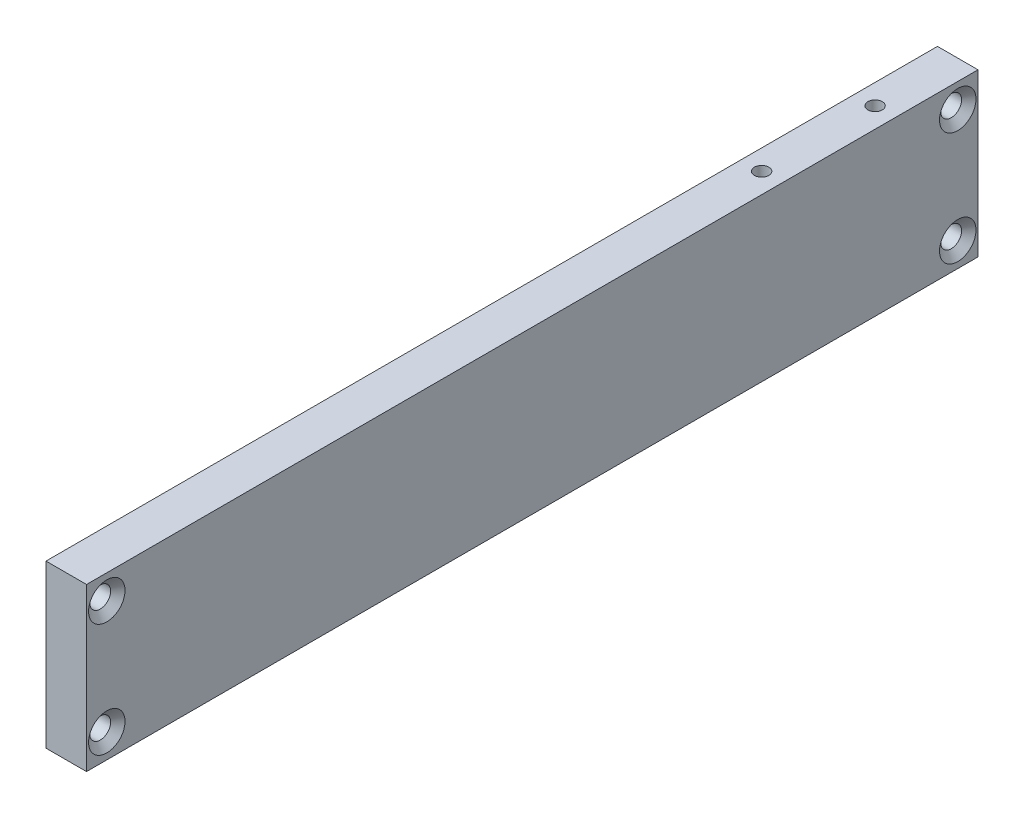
ISO-10303-21;
HEADER;
FILE_DESCRIPTION(('STEP AP214'),'2;1');
FILE_NAME('part.step','',(''),(''),'','','');
FILE_SCHEMA(('AUTOMOTIVE_DESIGN { 1 0 10303 214 1 1 1 1 }'));
ENDSEC;
DATA;
#1=APPLICATION_CONTEXT('core data for automotive mechanical design processes');
#2=APPLICATION_PROTOCOL_DEFINITION('international standard','automotive_design',2000,#1);
#3=PRODUCT_CONTEXT('',#1,'mechanical');
#4=PRODUCT('Part','Part','',(#3));
#5=PRODUCT_RELATED_PRODUCT_CATEGORY('part','',(#4));
#6=PRODUCT_DEFINITION_FORMATION('','',#4);
#7=PRODUCT_DEFINITION_CONTEXT('part definition',#1,'design');
#8=PRODUCT_DEFINITION('design','',#6,#7);
#9=PRODUCT_DEFINITION_SHAPE('','',#8);
#10=(LENGTH_UNIT() NAMED_UNIT(*) SI_UNIT(.MILLI.,.METRE.));
#11=(NAMED_UNIT(*) PLANE_ANGLE_UNIT() SI_UNIT($,.RADIAN.));
#12=(NAMED_UNIT(*) SI_UNIT($,.STERADIAN.) SOLID_ANGLE_UNIT());
#13=UNCERTAINTY_MEASURE_WITH_UNIT(LENGTH_MEASURE(1.E-05),#10,'distance_accuracy_value','');
#14=(GEOMETRIC_REPRESENTATION_CONTEXT(3) GLOBAL_UNCERTAINTY_ASSIGNED_CONTEXT((#13)) GLOBAL_UNIT_ASSIGNED_CONTEXT((#10,
#11,#12)) REPRESENTATION_CONTEXT('',''));
#15=CARTESIAN_POINT('',(0.,0.,0.));
#16=DIRECTION('',(0.,0.,1.));
#17=DIRECTION('',(1.,0.,0.));
#18=AXIS2_PLACEMENT_3D('',#15,#16,#17);
#19=CARTESIAN_POINT('',(6.35,15.24,69.85));
#20=DIRECTION('',(0.,0.,-1.));
#21=DIRECTION('',(-1.,0.,0.));
#22=AXIS2_PLACEMENT_3D('',#19,#20,#21);
#23=PLANE('',#22);
#24=DIRECTION('',(0.,-1.,0.));
#25=VECTOR('',#24,1.);
#26=CARTESIAN_POINT('',(0.,15.24,69.85));
#27=LINE('',#26,#25);
#28=CARTESIAN_POINT('',(0.,15.24,69.85));
#29=VERTEX_POINT('',#28);
#30=CARTESIAN_POINT('',(0.,-10.16,69.85));
#31=VERTEX_POINT('',#30);
#32=EDGE_CURVE('E143',#29,#31,#27,.T.);
#33=ORIENTED_EDGE('',*,*,#32,.T.);
#34=DIRECTION('',(-1.,0.,0.));
#35=VECTOR('',#34,1.);
#36=CARTESIAN_POINT('',(6.35,-10.16,69.85));
#37=LINE('',#36,#35);
#38=CARTESIAN_POINT('',(6.35,-10.16,69.85));
#39=VERTEX_POINT('',#38);
#40=EDGE_CURVE('E11',#39,#31,#37,.T.);
#41=ORIENTED_EDGE('',*,*,#40,.F.);
#42=DIRECTION('',(0.,-1.,0.));
#43=VECTOR('',#42,1.);
#44=CARTESIAN_POINT('',(6.35,15.24,69.85));
#45=LINE('',#44,#43);
#46=CARTESIAN_POINT('',(6.35,15.24,69.85));
#47=VERTEX_POINT('',#46);
#48=EDGE_CURVE('E144',#47,#39,#45,.T.);
#49=ORIENTED_EDGE('',*,*,#48,.F.);
#50=DIRECTION('',(-1.,0.,0.));
#51=VECTOR('',#50,1.);
#52=CARTESIAN_POINT('',(6.35,15.24,69.85));
#53=LINE('',#52,#51);
#54=EDGE_CURVE('E150',#47,#29,#53,.T.);
#55=ORIENTED_EDGE('',*,*,#54,.T.);
#56=EDGE_LOOP('',(#33,#41,#49,#55));
#57=FACE_BOUND('',#56,.T.);
#58=ADVANCED_FACE('F32',(#57),#23,.F.);
#59=CARTESIAN_POINT('',(6.35,-10.16,69.85));
#60=DIRECTION('',(0.,1.,0.));
#61=DIRECTION('',(0.,0.,1.));
#62=AXIS2_PLACEMENT_3D('',#59,#60,#61);
#63=PLANE('',#62);
#64=DIRECTION('',(0.,0.,-1.));
#65=VECTOR('',#64,1.);
#66=CARTESIAN_POINT('',(0.,-10.16,69.85));
#67=LINE('',#66,#65);
#68=CARTESIAN_POINT('',(0.,-10.16,-69.85));
#69=VERTEX_POINT('',#68);
#70=EDGE_CURVE('E153',#31,#69,#67,.T.);
#71=ORIENTED_EDGE('',*,*,#70,.T.);
#72=DIRECTION('',(-1.,0.,0.));
#73=VECTOR('',#72,1.);
#74=CARTESIAN_POINT('',(6.35,-10.16,-69.85));
#75=LINE('',#74,#73);
#76=CARTESIAN_POINT('',(6.35,-10.16,-69.85));
#77=VERTEX_POINT('',#76);
#78=EDGE_CURVE('E40',#77,#69,#75,.T.);
#79=ORIENTED_EDGE('',*,*,#78,.F.);
#80=DIRECTION('',(0.,0.,-1.));
#81=VECTOR('',#80,1.);
#82=CARTESIAN_POINT('',(6.35,-10.16,69.85));
#83=LINE('',#82,#81);
#84=EDGE_CURVE('E79',#39,#77,#83,.T.);
#85=ORIENTED_EDGE('',*,*,#84,.F.);
#86=ORIENTED_EDGE('',*,*,#40,.T.);
#87=EDGE_LOOP('',(#71,#79,#85,#86));
#88=FACE_BOUND('',#87,.T.);
#89=ADVANCED_FACE('F178',(#88),#63,.F.);
#90=CARTESIAN_POINT('',(6.35,15.24,-69.85));
#91=DIRECTION('',(0.,0.,1.));
#92=DIRECTION('',(1.,0.,0.));
#93=AXIS2_PLACEMENT_3D('',#90,#91,#92);
#94=PLANE('',#93);
#95=DIRECTION('',(0.,1.,0.));
#96=VECTOR('',#95,1.);
#97=CARTESIAN_POINT('',(0.,15.24,-69.85));
#98=LINE('',#97,#96);
#99=CARTESIAN_POINT('',(0.,15.24,-69.85));
#100=VERTEX_POINT('',#99);
#101=EDGE_CURVE('E66',#69,#100,#98,.T.);
#102=ORIENTED_EDGE('',*,*,#101,.T.);
#103=DIRECTION('',(-1.,0.,0.));
#104=VECTOR('',#103,1.);
#105=CARTESIAN_POINT('',(6.35,15.24,-69.85));
#106=LINE('',#105,#104);
#107=CARTESIAN_POINT('',(6.35,15.24,-69.85));
#108=VERTEX_POINT('',#107);
#109=EDGE_CURVE('E158',#108,#100,#106,.T.);
#110=ORIENTED_EDGE('',*,*,#109,.F.);
#111=DIRECTION('',(0.,1.,0.));
#112=VECTOR('',#111,1.);
#113=CARTESIAN_POINT('',(6.35,15.24,-69.85));
#114=LINE('',#113,#112);
#115=EDGE_CURVE('E147',#77,#108,#114,.T.);
#116=ORIENTED_EDGE('',*,*,#115,.F.);
#117=ORIENTED_EDGE('',*,*,#78,.T.);
#118=EDGE_LOOP('',(#102,#110,#116,#117));
#119=FACE_BOUND('',#118,.T.);
#120=ADVANCED_FACE('F160',(#119),#94,.F.);
#121=CARTESIAN_POINT('',(6.35,15.24,69.85));
#122=DIRECTION('',(0.,-1.,0.));
#123=DIRECTION('',(0.,0.,-1.));
#124=AXIS2_PLACEMENT_3D('',#121,#122,#123);
#125=PLANE('',#124);
#126=CARTESIAN_POINT('',(3.175,15.24,-39.116));
#127=DIRECTION('',(0.,1.,0.));
#128=DIRECTION('',(0.,0.,1.));
#129=AXIS2_PLACEMENT_3D('',#126,#127,#128);
#130=CIRCLE('',#129,1.13029999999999);
#131=CARTESIAN_POINT('',(3.175,15.24,-37.9857));
#132=VERTEX_POINT('',#131);
#133=EDGE_CURVE('E97',#132,#132,#130,.T.);
#134=ORIENTED_EDGE('',*,*,#133,.F.);
#135=EDGE_LOOP('',(#134));
#136=FACE_BOUND('',#135,.T.);
#137=CARTESIAN_POINT('',(3.175,15.24,-56.896));
#138=DIRECTION('',(0.,1.,0.));
#139=DIRECTION('',(0.,0.,1.));
#140=AXIS2_PLACEMENT_3D('',#137,#138,#139);
#141=CIRCLE('',#140,1.13029999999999);
#142=CARTESIAN_POINT('',(3.175,15.24,-55.7657));
#143=VERTEX_POINT('',#142);
#144=EDGE_CURVE('E96',#143,#143,#141,.T.);
#145=ORIENTED_EDGE('',*,*,#144,.F.);
#146=EDGE_LOOP('',(#145));
#147=FACE_BOUND('',#146,.T.);
#148=DIRECTION('',(0.,0.,1.));
#149=VECTOR('',#148,1.);
#150=CARTESIAN_POINT('',(0.,15.24,69.85));
#151=LINE('',#150,#149);
#152=EDGE_CURVE('E72',#100,#29,#151,.T.);
#153=ORIENTED_EDGE('',*,*,#152,.T.);
#154=ORIENTED_EDGE('',*,*,#54,.F.);
#155=DIRECTION('',(0.,0.,1.));
#156=VECTOR('',#155,1.);
#157=CARTESIAN_POINT('',(6.35,15.24,69.85));
#158=LINE('',#157,#156);
#159=EDGE_CURVE('E48',#108,#47,#158,.T.);
#160=ORIENTED_EDGE('',*,*,#159,.F.);
#161=ORIENTED_EDGE('',*,*,#109,.T.);
#162=EDGE_LOOP('',(#153,#154,#160,#161));
#163=FACE_BOUND('',#162,.T.);
#164=ADVANCED_FACE('F167',(#136,#147,#163),#125,.F.);
#165=CARTESIAN_POINT('',(6.35,-10.16,69.85));
#166=DIRECTION('',(1.,0.,0.));
#167=DIRECTION('',(0.,0.,-1.));
#168=AXIS2_PLACEMENT_3D('',#165,#166,#167);
#169=PLANE('',#168);
#170=CARTESIAN_POINT('',(6.35,11.43,66.675));
#171=DIRECTION('',(1.,0.,0.));
#172=DIRECTION('',(0.,0.,-1.));
#173=AXIS2_PLACEMENT_3D('',#170,#171,#172);
#174=CIRCLE('',#173,2.8575);
#175=CARTESIAN_POINT('',(6.35,11.43,63.8175));
#176=VERTEX_POINT('',#175);
#177=EDGE_CURVE('E107',#176,#176,#174,.T.);
#178=ORIENTED_EDGE('',*,*,#177,.F.);
#179=EDGE_LOOP('',(#178));
#180=FACE_BOUND('',#179,.T.);
#181=CARTESIAN_POINT('',(6.35,-6.35,66.675));
#182=DIRECTION('',(1.,0.,0.));
#183=DIRECTION('',(0.,0.,-1.));
#184=AXIS2_PLACEMENT_3D('',#181,#182,#183);
#185=CIRCLE('',#184,2.8575);
#186=CARTESIAN_POINT('',(6.35,-6.35,63.8175));
#187=VERTEX_POINT('',#186);
#188=EDGE_CURVE('E116',#187,#187,#185,.T.);
#189=ORIENTED_EDGE('',*,*,#188,.F.);
#190=EDGE_LOOP('',(#189));
#191=FACE_BOUND('',#190,.T.);
#192=CARTESIAN_POINT('',(6.35,11.43,-66.675));
#193=DIRECTION('',(1.,0.,0.));
#194=DIRECTION('',(0.,0.,-1.));
#195=AXIS2_PLACEMENT_3D('',#192,#193,#194);
#196=CIRCLE('',#195,2.8575);
#197=CARTESIAN_POINT('',(6.35,11.43,-69.5325));
#198=VERTEX_POINT('',#197);
#199=EDGE_CURVE('E125',#198,#198,#196,.T.);
#200=ORIENTED_EDGE('',*,*,#199,.F.);
#201=EDGE_LOOP('',(#200));
#202=FACE_BOUND('',#201,.T.);
#203=CARTESIAN_POINT('',(6.35,-6.35,-66.675));
#204=DIRECTION('',(1.,0.,0.));
#205=DIRECTION('',(0.,0.,-1.));
#206=AXIS2_PLACEMENT_3D('',#203,#204,#205);
#207=CIRCLE('',#206,2.8575);
#208=CARTESIAN_POINT('',(6.35,-6.35,-69.5325));
#209=VERTEX_POINT('',#208);
#210=EDGE_CURVE('E134',#209,#209,#207,.T.);
#211=ORIENTED_EDGE('',*,*,#210,.F.);
#212=EDGE_LOOP('',(#211));
#213=FACE_BOUND('',#212,.T.);
#214=ORIENTED_EDGE('',*,*,#48,.T.);
#215=ORIENTED_EDGE('',*,*,#84,.T.);
#216=ORIENTED_EDGE('',*,*,#115,.T.);
#217=ORIENTED_EDGE('',*,*,#159,.T.);
#218=EDGE_LOOP('',(#214,#215,#216,#217));
#219=FACE_BOUND('',#218,.T.);
#220=ADVANCED_FACE('F169',(#180,#191,#202,#213,#219),#169,.T.);
#221=CARTESIAN_POINT('',(0.,-10.16,69.85));
#222=DIRECTION('',(1.,0.,0.));
#223=DIRECTION('',(0.,0.,-1.));
#224=AXIS2_PLACEMENT_3D('',#221,#222,#223);
#225=PLANE('',#224);
#226=CARTESIAN_POINT('',(0.,11.43,66.675));
#227=DIRECTION('',(1.,0.,0.));
#228=DIRECTION('',(0.,0.,-1.));
#229=AXIS2_PLACEMENT_3D('',#226,#227,#228);
#230=CIRCLE('',#229,1.63195);
#231=CARTESIAN_POINT('',(0.,11.43,65.04305));
#232=VERTEX_POINT('',#231);
#233=EDGE_CURVE('E113',#232,#232,#230,.T.);
#234=ORIENTED_EDGE('',*,*,#233,.T.);
#235=EDGE_LOOP('',(#234));
#236=FACE_BOUND('',#235,.T.);
#237=CARTESIAN_POINT('',(0.,-6.35,66.675));
#238=DIRECTION('',(1.,0.,0.));
#239=DIRECTION('',(0.,0.,-1.));
#240=AXIS2_PLACEMENT_3D('',#237,#238,#239);
#241=CIRCLE('',#240,1.63195);
#242=CARTESIAN_POINT('',(0.,-6.35,65.04305));
#243=VERTEX_POINT('',#242);
#244=EDGE_CURVE('E122',#243,#243,#241,.T.);
#245=ORIENTED_EDGE('',*,*,#244,.T.);
#246=EDGE_LOOP('',(#245));
#247=FACE_BOUND('',#246,.T.);
#248=CARTESIAN_POINT('',(0.,11.43,-66.675));
#249=DIRECTION('',(1.,0.,0.));
#250=DIRECTION('',(0.,0.,-1.));
#251=AXIS2_PLACEMENT_3D('',#248,#249,#250);
#252=CIRCLE('',#251,1.63195);
#253=CARTESIAN_POINT('',(0.,11.43,-68.30695));
#254=VERTEX_POINT('',#253);
#255=EDGE_CURVE('E131',#254,#254,#252,.T.);
#256=ORIENTED_EDGE('',*,*,#255,.T.);
#257=EDGE_LOOP('',(#256));
#258=FACE_BOUND('',#257,.T.);
#259=CARTESIAN_POINT('',(0.,-6.35,-66.675));
#260=DIRECTION('',(1.,0.,0.));
#261=DIRECTION('',(0.,0.,-1.));
#262=AXIS2_PLACEMENT_3D('',#259,#260,#261);
#263=CIRCLE('',#262,1.63195);
#264=CARTESIAN_POINT('',(0.,-6.35,-68.30695));
#265=VERTEX_POINT('',#264);
#266=EDGE_CURVE('E140',#265,#265,#263,.T.);
#267=ORIENTED_EDGE('',*,*,#266,.T.);
#268=EDGE_LOOP('',(#267));
#269=FACE_BOUND('',#268,.T.);
#270=ORIENTED_EDGE('',*,*,#32,.F.);
#271=ORIENTED_EDGE('',*,*,#152,.F.);
#272=ORIENTED_EDGE('',*,*,#101,.F.);
#273=ORIENTED_EDGE('',*,*,#70,.F.);
#274=EDGE_LOOP('',(#270,#271,#272,#273));
#275=FACE_BOUND('',#274,.T.);
#276=ADVANCED_FACE('F163',(#236,#247,#258,#269,#275),#225,.F.);
#277=CARTESIAN_POINT('',(6.35,-6.35,-66.675));
#278=DIRECTION('',(1.,0.,0.));
#279=DIRECTION('',(0.,0.,-1.));
#280=AXIS2_PLACEMENT_3D('',#277,#278,#279);
#281=CYLINDRICAL_SURFACE('',#280,1.63195);
#282=ORIENTED_EDGE('',*,*,#266,.F.);
#283=EDGE_LOOP('',(#282));
#284=FACE_BOUND('',#283,.T.);
#285=CARTESIAN_POINT('',(5.32164144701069,-6.35,-66.675));
#286=DIRECTION('',(1.,0.,0.));
#287=DIRECTION('',(0.,0.,-1.));
#288=AXIS2_PLACEMENT_3D('',#285,#286,#287);
#289=CIRCLE('',#288,1.63195);
#290=CARTESIAN_POINT('',(5.32164144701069,-6.35,-68.30695));
#291=VERTEX_POINT('',#290);
#292=EDGE_CURVE('E137',#291,#291,#289,.T.);
#293=ORIENTED_EDGE('',*,*,#292,.T.);
#294=EDGE_LOOP('',(#293));
#295=FACE_BOUND('',#294,.T.);
#296=ADVANCED_FACE('F212',(#284,#295),#281,.F.);
#297=CARTESIAN_POINT('',(6.35,-6.35,-66.675));
#298=DIRECTION('',(1.,0.,0.));
#299=DIRECTION('',(0.,0.,-1.));
#300=AXIS2_PLACEMENT_3D('',#297,#298,#299);
#301=CONICAL_SURFACE('',#300,2.8575,0.872664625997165);
#302=ORIENTED_EDGE('',*,*,#292,.F.);
#303=EDGE_LOOP('',(#302));
#304=FACE_BOUND('',#303,.T.);
#305=ORIENTED_EDGE('',*,*,#210,.T.);
#306=EDGE_LOOP('',(#305));
#307=FACE_BOUND('',#306,.T.);
#308=ADVANCED_FACE('F221',(#304,#307),#301,.F.);
#309=CARTESIAN_POINT('',(6.35,11.43,-66.675));
#310=DIRECTION('',(1.,0.,0.));
#311=DIRECTION('',(0.,0.,-1.));
#312=AXIS2_PLACEMENT_3D('',#309,#310,#311);
#313=CYLINDRICAL_SURFACE('',#312,1.63195);
#314=ORIENTED_EDGE('',*,*,#255,.F.);
#315=EDGE_LOOP('',(#314));
#316=FACE_BOUND('',#315,.T.);
#317=CARTESIAN_POINT('',(5.32164144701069,11.43,-66.675));
#318=DIRECTION('',(1.,0.,0.));
#319=DIRECTION('',(0.,0.,-1.));
#320=AXIS2_PLACEMENT_3D('',#317,#318,#319);
#321=CIRCLE('',#320,1.63195);
#322=CARTESIAN_POINT('',(5.32164144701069,11.43,-68.30695));
#323=VERTEX_POINT('',#322);
#324=EDGE_CURVE('E128',#323,#323,#321,.T.);
#325=ORIENTED_EDGE('',*,*,#324,.T.);
#326=EDGE_LOOP('',(#325));
#327=FACE_BOUND('',#326,.T.);
#328=ADVANCED_FACE('F231',(#316,#327),#313,.F.);
#329=CARTESIAN_POINT('',(6.35,11.43,-66.675));
#330=DIRECTION('',(1.,0.,0.));
#331=DIRECTION('',(0.,0.,-1.));
#332=AXIS2_PLACEMENT_3D('',#329,#330,#331);
#333=CONICAL_SURFACE('',#332,2.8575,0.872664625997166);
#334=ORIENTED_EDGE('',*,*,#324,.F.);
#335=EDGE_LOOP('',(#334));
#336=FACE_BOUND('',#335,.T.);
#337=ORIENTED_EDGE('',*,*,#199,.T.);
#338=EDGE_LOOP('',(#337));
#339=FACE_BOUND('',#338,.T.);
#340=ADVANCED_FACE('F241',(#336,#339),#333,.F.);
#341=CARTESIAN_POINT('',(6.35,-6.35,66.675));
#342=DIRECTION('',(1.,0.,0.));
#343=DIRECTION('',(0.,0.,-1.));
#344=AXIS2_PLACEMENT_3D('',#341,#342,#343);
#345=CYLINDRICAL_SURFACE('',#344,1.63195);
#346=ORIENTED_EDGE('',*,*,#244,.F.);
#347=EDGE_LOOP('',(#346));
#348=FACE_BOUND('',#347,.T.);
#349=CARTESIAN_POINT('',(5.32164144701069,-6.35,66.675));
#350=DIRECTION('',(1.,0.,0.));
#351=DIRECTION('',(0.,0.,-1.));
#352=AXIS2_PLACEMENT_3D('',#349,#350,#351);
#353=CIRCLE('',#352,1.63195);
#354=CARTESIAN_POINT('',(5.32164144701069,-6.35,65.04305));
#355=VERTEX_POINT('',#354);
#356=EDGE_CURVE('E119',#355,#355,#353,.T.);
#357=ORIENTED_EDGE('',*,*,#356,.T.);
#358=EDGE_LOOP('',(#357));
#359=FACE_BOUND('',#358,.T.);
#360=ADVANCED_FACE('F251',(#348,#359),#345,.F.);
#361=CARTESIAN_POINT('',(6.35,-6.35,66.675));
#362=DIRECTION('',(1.,0.,0.));
#363=DIRECTION('',(0.,0.,-1.));
#364=AXIS2_PLACEMENT_3D('',#361,#362,#363);
#365=CONICAL_SURFACE('',#364,2.8575,0.872664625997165);
#366=ORIENTED_EDGE('',*,*,#356,.F.);
#367=EDGE_LOOP('',(#366));
#368=FACE_BOUND('',#367,.T.);
#369=ORIENTED_EDGE('',*,*,#188,.T.);
#370=EDGE_LOOP('',(#369));
#371=FACE_BOUND('',#370,.T.);
#372=ADVANCED_FACE('F261',(#368,#371),#365,.F.);
#373=CARTESIAN_POINT('',(6.35,11.43,66.675));
#374=DIRECTION('',(1.,0.,0.));
#375=DIRECTION('',(0.,0.,-1.));
#376=AXIS2_PLACEMENT_3D('',#373,#374,#375);
#377=CYLINDRICAL_SURFACE('',#376,1.63195);
#378=ORIENTED_EDGE('',*,*,#233,.F.);
#379=EDGE_LOOP('',(#378));
#380=FACE_BOUND('',#379,.T.);
#381=CARTESIAN_POINT('',(5.32164144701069,11.43,66.675));
#382=DIRECTION('',(1.,0.,0.));
#383=DIRECTION('',(0.,0.,-1.));
#384=AXIS2_PLACEMENT_3D('',#381,#382,#383);
#385=CIRCLE('',#384,1.63195);
#386=CARTESIAN_POINT('',(5.32164144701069,11.43,65.04305));
#387=VERTEX_POINT('',#386);
#388=EDGE_CURVE('E110',#387,#387,#385,.T.);
#389=ORIENTED_EDGE('',*,*,#388,.T.);
#390=EDGE_LOOP('',(#389));
#391=FACE_BOUND('',#390,.T.);
#392=ADVANCED_FACE('F271',(#380,#391),#377,.F.);
#393=CARTESIAN_POINT('',(6.35,11.43,66.675));
#394=DIRECTION('',(1.,0.,0.));
#395=DIRECTION('',(0.,0.,-1.));
#396=AXIS2_PLACEMENT_3D('',#393,#394,#395);
#397=CONICAL_SURFACE('',#396,2.8575,0.872664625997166);
#398=ORIENTED_EDGE('',*,*,#388,.F.);
#399=EDGE_LOOP('',(#398));
#400=FACE_BOUND('',#399,.T.);
#401=ORIENTED_EDGE('',*,*,#177,.T.);
#402=EDGE_LOOP('',(#401));
#403=FACE_BOUND('',#402,.T.);
#404=ADVANCED_FACE('F281',(#400,#403),#397,.F.);
#405=CARTESIAN_POINT('',(3.175,3.81,-56.896));
#406=DIRECTION('',(0.,1.,0.));
#407=DIRECTION('',(0.,0.,1.));
#408=AXIS2_PLACEMENT_3D('',#405,#406,#407);
#409=CONICAL_SURFACE('',#408,1.13029999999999,1.02974425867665);
#410=CARTESIAN_POINT('',(3.175,3.13084724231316,-56.896));
#411=VERTEX_POINT('',#410);
#412=VERTEX_LOOP('',#411);
#413=FACE_BOUND('',#412,.T.);
#414=CARTESIAN_POINT('',(3.175,3.81,-56.896));
#415=DIRECTION('',(0.,1.,0.));
#416=DIRECTION('',(0.,0.,1.));
#417=AXIS2_PLACEMENT_3D('',#414,#415,#416);
#418=CIRCLE('',#417,1.13029999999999);
#419=CARTESIAN_POINT('',(3.175,3.81,-55.7657));
#420=VERTEX_POINT('',#419);
#421=EDGE_CURVE('E100',#420,#420,#418,.T.);
#422=ORIENTED_EDGE('',*,*,#421,.T.);
#423=EDGE_LOOP('',(#422));
#424=FACE_BOUND('',#423,.T.);
#425=ADVANCED_FACE('F291',(#413,#424),#409,.F.);
#426=CARTESIAN_POINT('',(3.175,15.24,-56.896));
#427=DIRECTION('',(0.,1.,0.));
#428=DIRECTION('',(0.,0.,1.));
#429=AXIS2_PLACEMENT_3D('',#426,#427,#428);
#430=CYLINDRICAL_SURFACE('',#429,1.13029999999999);
#431=ORIENTED_EDGE('',*,*,#421,.F.);
#432=EDGE_LOOP('',(#431));
#433=FACE_BOUND('',#432,.T.);
#434=ORIENTED_EDGE('',*,*,#144,.T.);
#435=EDGE_LOOP('',(#434));
#436=FACE_BOUND('',#435,.T.);
#437=ADVANCED_FACE('F90',(#433,#436),#430,.F.);
#438=CARTESIAN_POINT('',(3.175,3.81,-39.116));
#439=DIRECTION('',(0.,1.,0.));
#440=DIRECTION('',(0.,0.,1.));
#441=AXIS2_PLACEMENT_3D('',#438,#439,#440);
#442=CONICAL_SURFACE('',#441,1.13029999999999,1.02974425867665);
#443=CARTESIAN_POINT('',(3.175,3.13084724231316,-39.116));
#444=VERTEX_POINT('',#443);
#445=VERTEX_LOOP('',#444);
#446=FACE_BOUND('',#445,.T.);
#447=CARTESIAN_POINT('',(3.175,3.81,-39.116));
#448=DIRECTION('',(0.,1.,0.));
#449=DIRECTION('',(0.,0.,1.));
#450=AXIS2_PLACEMENT_3D('',#447,#448,#449);
#451=CIRCLE('',#450,1.13029999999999);
#452=CARTESIAN_POINT('',(3.175,3.81,-37.9857));
#453=VERTEX_POINT('',#452);
#454=EDGE_CURVE('E94',#453,#453,#451,.T.);
#455=ORIENTED_EDGE('',*,*,#454,.T.);
#456=EDGE_LOOP('',(#455));
#457=FACE_BOUND('',#456,.T.);
#458=ADVANCED_FACE('F86',(#446,#457),#442,.F.);
#459=CARTESIAN_POINT('',(3.175,15.24,-39.116));
#460=DIRECTION('',(0.,1.,0.));
#461=DIRECTION('',(0.,0.,1.));
#462=AXIS2_PLACEMENT_3D('',#459,#460,#461);
#463=CYLINDRICAL_SURFACE('',#462,1.13029999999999);
#464=ORIENTED_EDGE('',*,*,#454,.F.);
#465=EDGE_LOOP('',(#464));
#466=FACE_BOUND('',#465,.T.);
#467=ORIENTED_EDGE('',*,*,#133,.T.);
#468=EDGE_LOOP('',(#467));
#469=FACE_BOUND('',#468,.T.);
#470=ADVANCED_FACE('F89',(#466,#469),#463,.F.);
#471=CLOSED_SHELL('',(#58,#89,#120,#164,#220,#276,#296,#308,#328,#340,#360,#372,#392,#404,#425,
#437,#458,#470));
#472=MANIFOLD_SOLID_BREP('B2',#471);
#473=ADVANCED_BREP_SHAPE_REPRESENTATION('',(#18,#472),#14);
#474=SHAPE_DEFINITION_REPRESENTATION(#9,#473);
ENDSEC;
END-ISO-10303-21;
